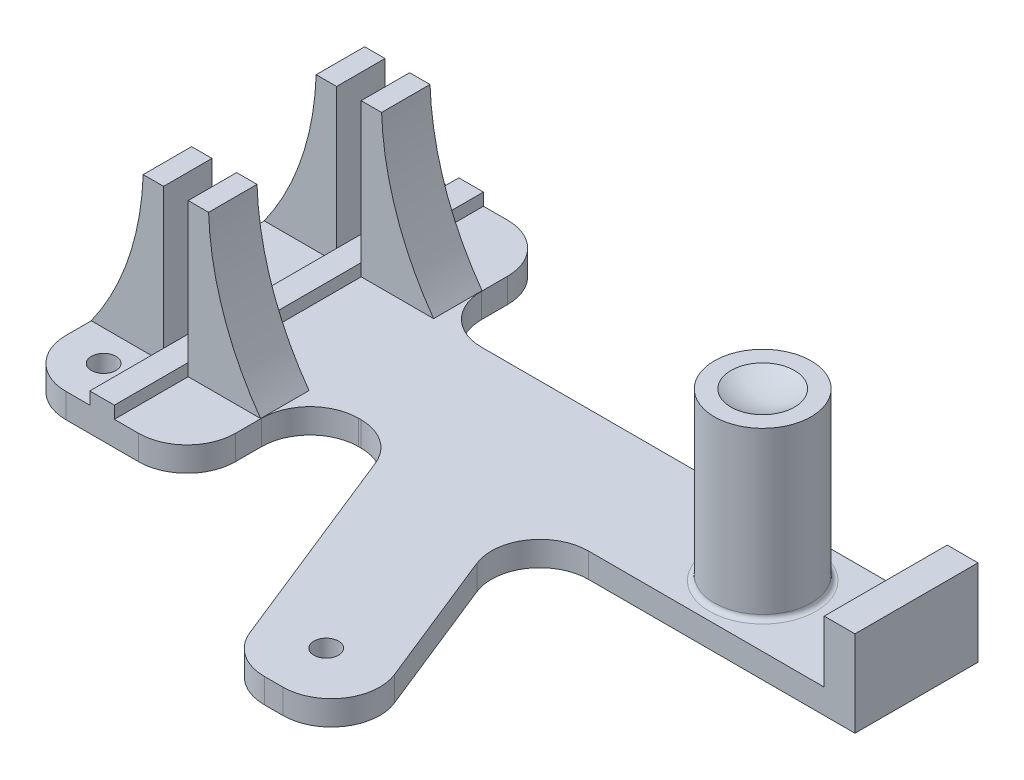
from build123d import *

# Parameters (mm, degrees)
BOSS_EXTRUDE1_DEPTH = 5.08
BOSS_EXTRUDE2_DEPTH = 10
SKETCH3_R           = 10
BOSS_EXTRUDE3_DEPTH = 34.29
FILLET1_R           = 1
SKETCH9_W           = 6.35
SKETCH9_H           = 25.4
BOSS_EXTRUDE6_DEPTH = 12.7
BOSS_EXTRUDE7_DEPTH = 5.08
FILLET4_R           = 10
FILLET5_R           = 10
CUT_EXTRUDE1_REACH  = 156.38
SKETCH18_R          = 2.54
SKETCH19_W          = 5.08
SKETCH19_H          = 76.2
BOSS_EXTRUDE8_DEPTH = 2.54


with BuildPart() as part:
    # Sketch1 → Boss-Extrude1 (new body)
    with BuildSketch(Plane(origin=(0, 0, 0), x_dir=(1, 0, 0), z_dir=(0, 1, 0))):
        with BuildLine():
            Line((20.08, 28.1), (20.08, 22.7))
            ThreePointArc((20.08, 22.7), (23.008932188, 15.628932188), (30.08, 12.7))
            Line((30.08, 12.7), (126.24, 12.7))
            Line((126.24, 12.7), (132.59, 12.7))
            Line((132.59, 12.7), (132.59, 0))
            Line((132.59, 0), (132.59, -12.7))
            Line((132.59, -12.7), (126.24, -12.7))
            Line((126.24, -12.7), (30.08, -12.7))
            ThreePointArc((30.08, -12.7), (23.008932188, -15.628932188), (20.08, -22.7))
            Line((20.08, -22.7), (20.08, -28.1))
            ThreePointArc((20.08, -28.1), (17.151067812, -35.171067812), (10.08, -38.1))
            Line((10.08, -38.1), (-4.92, -38.1))
            ThreePointArc((-4.92, -38.1), (-11.991067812, -35.171067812), (-14.92, -28.1))
            Line((-14.92, -28.1), (-14.92, 28.1))
            ThreePointArc((-14.92, 28.1), (-11.991067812, 35.171067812), (-4.92, 38.1))
            Line((-4.92, 38.1), (10.08, 38.1))
            ThreePointArc((10.08, 38.1), (17.151067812, 35.171067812), (20.08, 28.1))
        make_face()
    extrude(amount=-BOSS_EXTRUDE1_DEPTH)

    # Sketch2 → Boss-Extrude2 (add)
    with BuildSketch(Plane.XY.offset(22.86)):
        with BuildLine():
            Line((0, 0), (-14.953299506, 0))
            ThreePointArc((-14.953299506, 0), (-7.255141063, 14.95657571), (-4.209502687, 31.5))
            Line((-4.209502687, 31.5), (0, 31.5))
            Line((0, 31.5), (0, 0))
        make_face()
        with BuildLine():
            Line((5.08, 0), (20.033299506, 0))
            ThreePointArc((20.033299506, 0), (12.335141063, 14.95657571), (9.289502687, 31.5))
            Line((9.289502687, 31.5), (5.08, 31.5))
            Line((5.08, 31.5), (5.08, 0))
        make_face()
    boss_extrude2 = extrude(amount=-BOSS_EXTRUDE2_DEPTH)

    # Mirror1: Boss-Extrude2 across plane
    add(boss_extrude2.mirror(Plane.XY))

    # Sketch3 → Boss-Extrude3 (add)
    with BuildSketch(Plane(origin=(0, 0, 0), x_dir=(1, 0, 0), z_dir=(0, 1, 0))):
        with Locations(Location((100.84, 0, 0), (0, 0, 270))):
            Circle(SKETCH3_R)
    extrude(amount=BOSS_EXTRUDE3_DEPTH)

    # Fillet1
    fillet1_edges = [part.edges().sort_by_distance(p)[0] for p in [
        (100.84, 0, -10),
    ]]
    fillet(fillet1_edges, radius=FILLET1_R)

    # Sketch4 → Cut-Revolve1 (revolve, cut)
    with BuildSketch(Plane.XY):
        with BuildLine():
            Line((100.84, 34.29), (107.399510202, 34.29))
            ThreePointArc((107.399510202, 34.29), (104.216336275, 33.092422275), (100.84, 32.683592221))
            Line((100.84, 32.683592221), (100.84, 34.29))
        make_face()
    revolve(axis=Axis((100.84, 34.29, 0), (0, -1, 0)), mode=Mode.SUBTRACT)

    # Sketch9 → Boss-Extrude6 (add)
    with BuildSketch(Plane(origin=(0, 0, 0), x_dir=(1, 0, 0), z_dir=(0, 1, 0))):
        with Locations((129.415, 0)):
            Rectangle(SKETCH9_W, SKETCH9_H)
    extrude(amount=BOSS_EXTRUDE6_DEPTH)

    # Sketch17 → Boss-Extrude7 (add)
    with BuildSketch(Plane(origin=(0, 0, 0), x_dir=(1, 0, 0), z_dir=(0, 1, 0))):
        with BuildLine():
            Line((37.34, -12.7), (57.230452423, -62.301920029))
            ThreePointArc((57.230452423, -62.301920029), (60.909296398, -66.863091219), (66.512010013, -68.58))
            Line((66.512010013, -68.58), (70.36390259, -68.58))
            ThreePointArc((70.36390259, -68.58), (78.646993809, -64.182713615), (79.64546018, -54.858079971))
            Line((79.64546018, -54.858079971), (62.74, -12.7))
            Line((62.74, -12.7), (37.34, -12.7))
        make_face()
    extrude(amount=-BOSS_EXTRUDE7_DEPTH)

    # Fillet4
    fillet4_edges = [part.edges().sort_by_distance(p)[0] for p in [
        (62.74, -2.54, 12.7),
    ]]
    fillet(fillet4_edges, radius=FILLET4_R)

    # Fillet5
    fillet5_edges = [part.edges().sort_by_distance(p)[0] for p in [
        (37.34, -2.54, 12.7),
    ]]
    fillet(fillet5_edges, radius=FILLET5_R)

    # Sketch18 → Cut-Extrude1 (cut, up to next)
    with BuildSketch(Plane.XZ.offset(5.08), mode=Mode.PRIVATE) as cut_extrude1_sk1:
        with Locations(Location((-6.03, 29.21, 0), (0, 0, 270))):
            Circle(SKETCH18_R)
    cut_extrude1_tool1 = extrude(cut_extrude1_sk1.sketch, amount=-CUT_EXTRUDE1_REACH, mode=Mode.PRIVATE) & part.part
    # Sketch18 → Cut-Extrude1 (cut, up to next)
    with BuildSketch(Plane.XZ.offset(5.08), mode=Mode.PRIVATE) as cut_extrude1_sk2:
        with Locations(Location((-6.03, -29.21, 0), (0, 0, 90))):
            Circle(SKETCH18_R)
    cut_extrude1_tool2 = extrude(cut_extrude1_sk2.sketch, amount=-CUT_EXTRUDE1_REACH, mode=Mode.PRIVATE) & part.part
    # Sketch18 → Cut-Extrude1 (cut, up to next)
    with BuildSketch(Plane.XZ.offset(5.08), mode=Mode.PRIVATE) as cut_extrude1_sk3:
        with Locations(Location((67.864523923, 57.15, 0), (0, 0, 270))):
            Circle(SKETCH18_R)
    cut_extrude1_tool3 = extrude(cut_extrude1_sk3.sketch, amount=-CUT_EXTRUDE1_REACH, mode=Mode.PRIVATE) & part.part
    # Sketch18 → Cut-Extrude1 (cut, up to next)
    with BuildSketch(Plane.XZ.offset(5.08), mode=Mode.PRIVATE) as cut_extrude1_sk4:
        with Locations(Location((118.62, 0, 0), (0, 0, 270))):
            Circle(SKETCH18_R)
    cut_extrude1_tool4 = extrude(cut_extrude1_sk4.sketch, amount=-CUT_EXTRUDE1_REACH, mode=Mode.PRIVATE) & part.part
    add(cut_extrude1_tool1.solids().sort_by_distance((-6.03, -5.08, 29.21))[0], mode=Mode.SUBTRACT)
    add(cut_extrude1_tool2.solids().sort_by_distance((-6.03, -5.08, -29.21))[0], mode=Mode.SUBTRACT)
    add(cut_extrude1_tool3.solids().sort_by_distance((67.864524, -5.08, 57.15))[0], mode=Mode.SUBTRACT)
    add(cut_extrude1_tool4.solids().sort_by_distance((118.62, -5.08, 0))[0], mode=Mode.SUBTRACT)

    # Sketch19 → Boss-Extrude8 (add)
    with BuildSketch(Plane(origin=(0, 0, 0), x_dir=(1, 0, 0), z_dir=(0, 1, 0))):
        with Locations((2.54, 0)):
            Rectangle(SKETCH19_W, SKETCH19_H)
    extrude(amount=BOSS_EXTRUDE8_DEPTH)


solid = part.part
